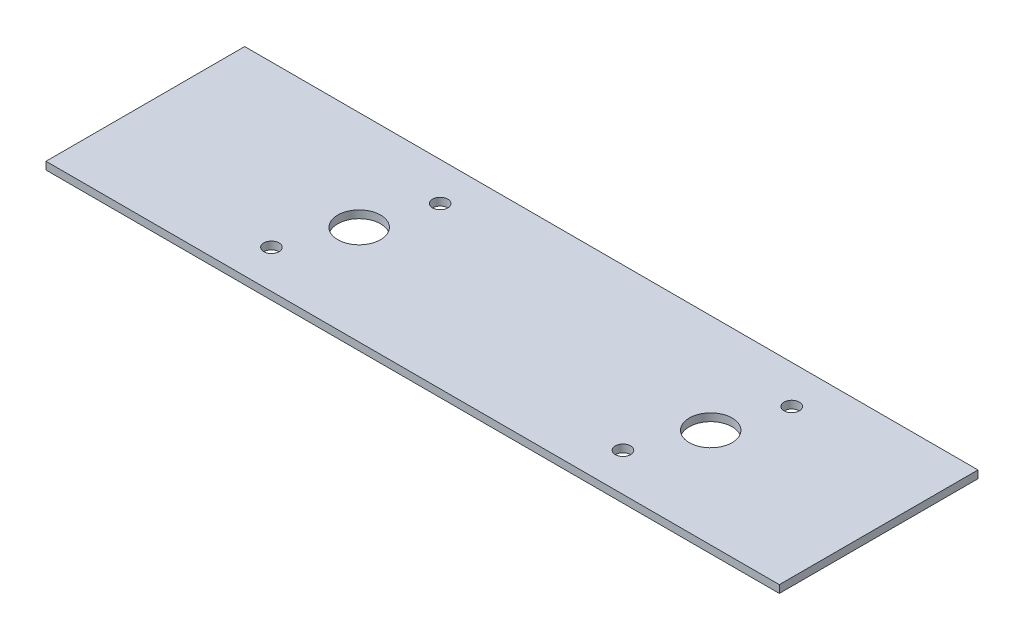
from build123d import *

# Parameters (mm, degrees)
SKETCH1_W           = 304.6625
SKETCH1_H           = 82.55
BOSS_EXTRUDE1_DEPTH = 3.175
SKETCH2_R           = 8.89
CUT_EXTRUDE1_DEPTH  = 3.175
SKETCH3_R           = 3.175
CUT_EXTRUDE2_DEPTH  = 12.7


with BuildPart() as part:
    # Sketch1 → Boss-Extrude1 (new body)
    with BuildSketch(Plane(origin=(0, 402.212122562, 0), x_dir=(1, 0, 0), z_dir=(0, 1, 0))):
        with Locations((-759.871620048, -1297.364151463)):
            Rectangle(SKETCH1_W, SKETCH1_H)
    extrude(amount=BOSS_EXTRUDE1_DEPTH)

    # Sketch2 → Cut-Extrude1 (cut)
    with BuildSketch(Plane(origin=(0, 405.387122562, 0), x_dir=(1, 0, 0), z_dir=(0, 1, 0))):
        with Locations(Location((-823.371620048, -1297.364151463, 0), (0, 0, 270))):
            Circle(SKETCH2_R)
        with Locations(Location((-677.321620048, -1297.364151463, 0), (0, 0, 270))):
            Circle(SKETCH2_R)
    extrude(amount=-CUT_EXTRUDE1_DEPTH, mode=Mode.SUBTRACT)

    # Sketch3 → Cut-Extrude2 (cut)
    with BuildSketch(Plane.XZ.offset(-402.212122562)):
        with Locations(Location((-834.418620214, 1322.76415139, 0), (0, 0, 270))):
            Circle(SKETCH3_R)
        with Locations(Location((-815.118619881, 1271.964151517, 0), (0, 0, 270))):
            Circle(SKETCH3_R)
        with Locations(Location((-688.368620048, 1322.764151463, 0), (0, 0, 270))):
            Circle(SKETCH3_R)
        with Locations(Location((-669.068620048, 1271.964151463, 0), (0, 0, 270))):
            Circle(SKETCH3_R)
    extrude(amount=-CUT_EXTRUDE2_DEPTH, mode=Mode.SUBTRACT)


solid = part.part
